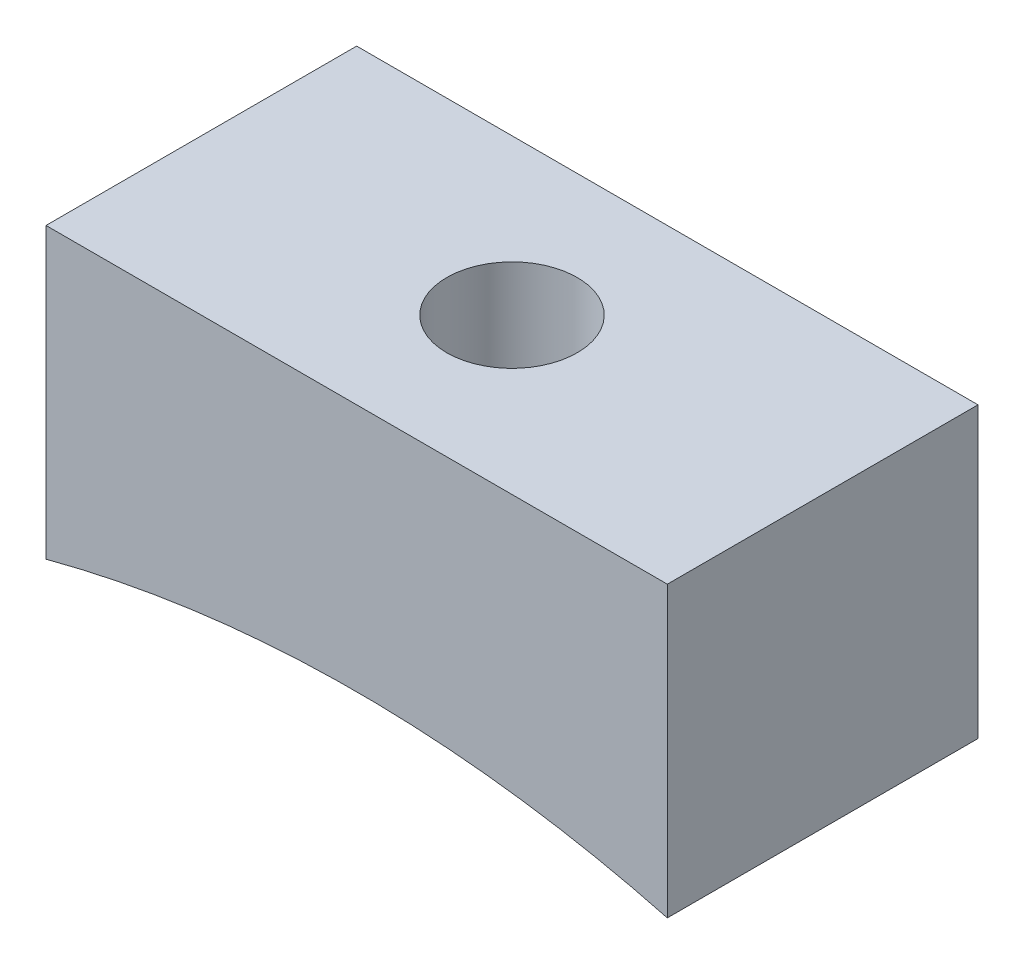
from build123d import *

# Parameters (mm, degrees)
LINEAR_AUSTRAGEN1_DEPTH      = 5
LINEAR_AUSTRAGEN1_DEPTH_BACK = 5
LINEAR_AUSTRAGEN2_REACH      = 16.545
LINEAR_AUSTRAGEN2_END_RADIUS = 39
SKIZZE2_R                    = 2.1


with BuildPart() as part:
    # Skizze1 → Linear austragen1 (new, two sides: drawn at the far end of the back side and taken through both)
    with BuildSketch(Plane.XY.offset(-LINEAR_AUSTRAGEN1_DEPTH_BACK)):
        with BuildLine():
            Line((-10, 37.69615365), (-10, 47))
            Line((-10, 47), (10, 47))
            Line((10, 47), (10, 37.69615365))
            ThreePointArc((10, 37.69615365), (0, 39), (-10, 37.69615365))
        make_face()
    extrude(amount=LINEAR_AUSTRAGEN1_DEPTH + LINEAR_AUSTRAGEN1_DEPTH_BACK)

    # Linear austragen2: up to this cylinder (the profile starts outside it)
    linear_austragen2_end = Plane(origin=(0, 0, 0), z_dir=(0, 0, 1)) * Cylinder(LINEAR_AUSTRAGEN2_END_RADIUS, 112.09, mode=Mode.PRIVATE)
    # Skizze2 → Linear austragen2 (cut, up to the surface)
    with BuildSketch(Plane(origin=(0, 47, 0), x_dir=(1, 0, 0), z_dir=(0, 1, 0)), mode=Mode.PRIVATE) as linear_austragen2_sk1:
        with Locations(Location((0, 0, 0), (0, 0, 270))):
            Circle(SKIZZE2_R)
    linear_austragen2_tool1 = extrude(linear_austragen2_sk1.sketch, amount=-LINEAR_AUSTRAGEN2_REACH, mode=Mode.PRIVATE) - linear_austragen2_end
    add(linear_austragen2_tool1.solids().sort_by_distance((0, 47, 0))[0], mode=Mode.SUBTRACT)


solid = part.part
